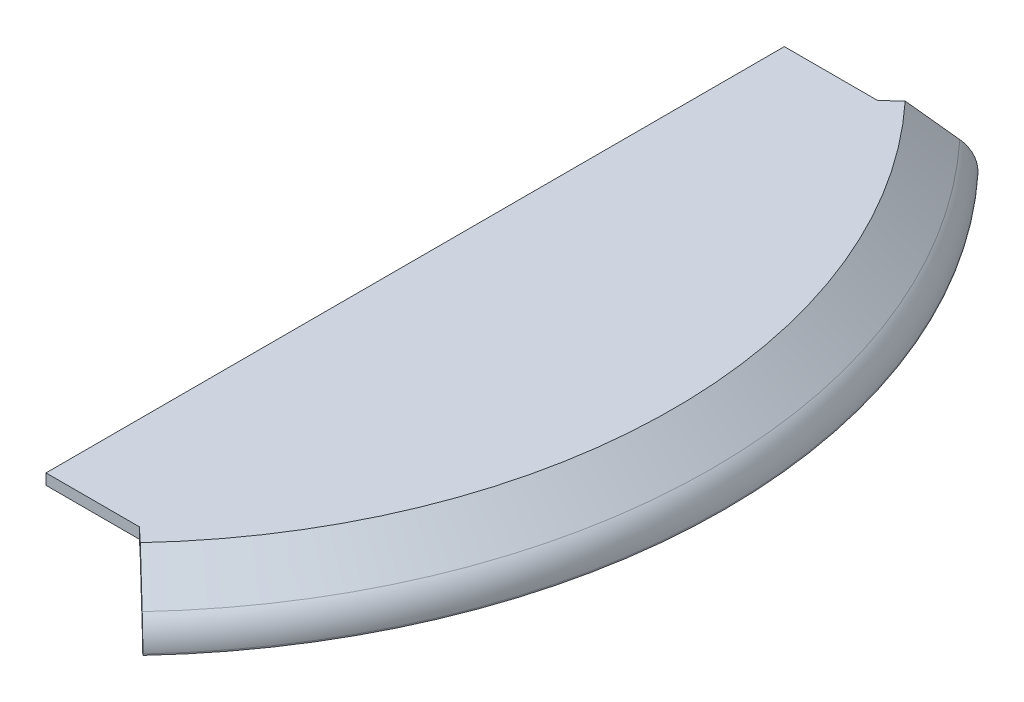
ISO-10303-21;
HEADER;
FILE_DESCRIPTION(('STEP AP214'),'2;1');
FILE_NAME('part.step','',(''),(''),'','','');
FILE_SCHEMA(('AUTOMOTIVE_DESIGN { 1 0 10303 214 1 1 1 1 }'));
ENDSEC;
DATA;
#1=APPLICATION_CONTEXT('core data for automotive mechanical design processes');
#2=APPLICATION_PROTOCOL_DEFINITION('international standard','automotive_design',2000,#1);
#3=PRODUCT_CONTEXT('',#1,'mechanical');
#4=PRODUCT('Part','Part','',(#3));
#5=PRODUCT_RELATED_PRODUCT_CATEGORY('part','',(#4));
#6=PRODUCT_DEFINITION_FORMATION('','',#4);
#7=PRODUCT_DEFINITION_CONTEXT('part definition',#1,'design');
#8=PRODUCT_DEFINITION('design','',#6,#7);
#9=PRODUCT_DEFINITION_SHAPE('','',#8);
#10=(LENGTH_UNIT() NAMED_UNIT(*) SI_UNIT(.MILLI.,.METRE.));
#11=(NAMED_UNIT(*) PLANE_ANGLE_UNIT() SI_UNIT($,.RADIAN.));
#12=(NAMED_UNIT(*) SI_UNIT($,.STERADIAN.) SOLID_ANGLE_UNIT());
#13=UNCERTAINTY_MEASURE_WITH_UNIT(LENGTH_MEASURE(1.E-05),#10,'distance_accuracy_value','');
#14=(GEOMETRIC_REPRESENTATION_CONTEXT(3) GLOBAL_UNCERTAINTY_ASSIGNED_CONTEXT((#13)) GLOBAL_UNIT_ASSIGNED_CONTEXT((#10,
#11,#12)) REPRESENTATION_CONTEXT('',''));
#15=CARTESIAN_POINT('',(0.,0.,0.));
#16=DIRECTION('',(0.,0.,1.));
#17=DIRECTION('',(1.,0.,0.));
#18=AXIS2_PLACEMENT_3D('',#15,#16,#17);
#19=CARTESIAN_POINT('',(0.,-23.4118667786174,0.));
#20=DIRECTION('',(0.,-1.,0.));
#21=DIRECTION('',(0.,0.,-1.));
#22=AXIS2_PLACEMENT_3D('',#19,#20,#21);
#23=CYLINDRICAL_SURFACE('',#22,170.);
#24=DIRECTION('',(0.,1.,0.));
#25=VECTOR('',#24,1.);
#26=CARTESIAN_POINT('',(124.330129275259,0.,-115.939721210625));
#27=LINE('',#26,#25);
#28=CARTESIAN_POINT('',(124.330129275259,0.,-115.939721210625));
#29=VERTEX_POINT('',#28);
#30=CARTESIAN_POINT('',(124.330129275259,0.336923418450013,-115.939721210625));
#31=VERTEX_POINT('',#30);
#32=EDGE_CURVE('E129',#29,#31,#27,.T.);
#33=ORIENTED_EDGE('',*,*,#32,.T.);
#34=CARTESIAN_POINT('',(0.,0.336923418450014,0.));
#35=DIRECTION('',(0.,-1.,0.));
#36=DIRECTION('',(0.,0.,-1.));
#37=AXIS2_PLACEMENT_3D('',#34,#35,#36);
#38=CIRCLE('',#37,170.);
#39=CARTESIAN_POINT('',(124.330129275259,0.336923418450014,115.939721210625));
#40=VERTEX_POINT('',#39);
#41=EDGE_CURVE('E187',#31,#40,#38,.T.);
#42=ORIENTED_EDGE('',*,*,#41,.T.);
#43=DIRECTION('',(0.,1.,0.));
#44=VECTOR('',#43,1.);
#45=CARTESIAN_POINT('',(124.330129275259,0.,115.939721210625));
#46=LINE('',#45,#44);
#47=CARTESIAN_POINT('',(124.330129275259,0.,115.939721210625));
#48=VERTEX_POINT('',#47);
#49=EDGE_CURVE('E45',#48,#40,#46,.T.);
#50=ORIENTED_EDGE('',*,*,#49,.F.);
#51=CARTESIAN_POINT('',(0.,0.,0.));
#52=DIRECTION('',(0.,-1.,0.));
#53=DIRECTION('',(0.,0.,-1.));
#54=AXIS2_PLACEMENT_3D('',#51,#52,#53);
#55=CIRCLE('',#54,170.);
#56=EDGE_CURVE('E206',#29,#48,#55,.T.);
#57=ORIENTED_EDGE('',*,*,#56,.F.);
#58=EDGE_LOOP('',(#33,#42,#50,#57));
#59=FACE_BOUND('',#58,.T.);
#60=ADVANCED_FACE('F31',(#59),#23,.T.);
#61=CARTESIAN_POINT('',(-170.,0.,0.));
#62=DIRECTION('',(0.,1.,0.));
#63=DIRECTION('',(0.,0.,1.));
#64=AXIS2_PLACEMENT_3D('',#61,#62,#63);
#65=PLANE('',#64);
#66=DIRECTION('',(-0.73135370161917,0.,0.681998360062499));
#67=VECTOR('',#66,1.);
#68=CARTESIAN_POINT('',(109.91779277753,0.,-102.5));
#69=LINE('',#68,#67);
#70=CARTESIAN_POINT('',(122.86742187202,0.,-114.5757244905));
#71=VERTEX_POINT('',#70);
#72=EDGE_CURVE('E153',#29,#71,#69,.T.);
#73=ORIENTED_EDGE('',*,*,#72,.F.);
#74=ORIENTED_EDGE('',*,*,#56,.T.);
#75=DIRECTION('',(0.731353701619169,0.,0.6819983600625));
#76=VECTOR('',#75,1.);
#77=CARTESIAN_POINT('',(109.91779277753,0.,102.5));
#78=LINE('',#77,#76);
#79=CARTESIAN_POINT('',(122.86742187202,0.,114.5757244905));
#80=VERTEX_POINT('',#79);
#81=EDGE_CURVE('E151',#80,#48,#78,.T.);
#82=ORIENTED_EDGE('',*,*,#81,.F.);
#83=CARTESIAN_POINT('',(0.,0.,0.));
#84=DIRECTION('',(0.,-1.,0.));
#85=DIRECTION('',(0.,0.,-1.));
#86=AXIS2_PLACEMENT_3D('',#83,#84,#85);
#87=CIRCLE('',#86,168.);
#88=EDGE_CURVE('E203',#71,#80,#87,.T.);
#89=ORIENTED_EDGE('',*,*,#88,.F.);
#90=EDGE_LOOP('',(#73,#74,#82,#89));
#91=FACE_BOUND('',#90,.T.);
#92=ADVANCED_FACE('F223',(#91),#65,.F.);
#93=CARTESIAN_POINT('',(0.,-23.4118667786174,0.));
#94=DIRECTION('',(0.,-1.,0.));
#95=DIRECTION('',(0.,0.,-1.));
#96=AXIS2_PLACEMENT_3D('',#93,#94,#95);
#97=CYLINDRICAL_SURFACE('',#96,168.);
#98=DIRECTION('',(0.,-1.,0.));
#99=VECTOR('',#98,1.);
#100=CARTESIAN_POINT('',(122.86742187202,-23.4118667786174,-114.5757244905));
#101=LINE('',#100,#99);
#102=CARTESIAN_POINT('',(122.867421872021,3.5,-114.5757244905));
#103=VERTEX_POINT('',#102);
#104=EDGE_CURVE('E180',#71,#103,#101,.F.);
#105=ORIENTED_EDGE('',*,*,#104,.F.);
#106=ORIENTED_EDGE('',*,*,#88,.T.);
#107=DIRECTION('',(0.,-1.,0.));
#108=VECTOR('',#107,1.);
#109=CARTESIAN_POINT('',(122.86742187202,-23.4118667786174,114.5757244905));
#110=LINE('',#109,#108);
#111=CARTESIAN_POINT('',(122.86742187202,3.5,114.5757244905));
#112=VERTEX_POINT('',#111);
#113=EDGE_CURVE('E171',#112,#80,#110,.T.);
#114=ORIENTED_EDGE('',*,*,#113,.F.);
#115=CARTESIAN_POINT('',(0.,3.5,0.));
#116=DIRECTION('',(0.,-1.,0.));
#117=DIRECTION('',(0.,0.,-1.));
#118=AXIS2_PLACEMENT_3D('',#115,#116,#117);
#119=CIRCLE('',#118,168.);
#120=EDGE_CURVE('E200',#103,#112,#119,.T.);
#121=ORIENTED_EDGE('',*,*,#120,.F.);
#122=EDGE_LOOP('',(#105,#106,#114,#121));
#123=FACE_BOUND('',#122,.T.);
#124=ADVANCED_FACE('F229',(#123),#97,.F.);
#125=CARTESIAN_POINT('',(-167.12045890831,3.5,0.));
#126=DIRECTION('',(0.,1.,0.));
#127=DIRECTION('',(0.,0.,1.));
#128=AXIS2_PLACEMENT_3D('',#125,#126,#127);
#129=PLANE('',#128);
#130=DIRECTION('',(-0.73135370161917,0.,0.681998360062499));
#131=VECTOR('',#130,1.);
#132=CARTESIAN_POINT('',(-89.3890964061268,3.5,83.3566809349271));
#133=LINE('',#132,#131);
#134=CARTESIAN_POINT('',(122.224166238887,3.5,-113.97587890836));
#135=VERTEX_POINT('',#134);
#136=EDGE_CURVE('E178',#103,#135,#133,.T.);
#137=ORIENTED_EDGE('',*,*,#136,.F.);
#138=ORIENTED_EDGE('',*,*,#120,.T.);
#139=DIRECTION('',(0.731353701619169,0.,0.6819983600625));
#140=VECTOR('',#139,1.);
#141=CARTESIAN_POINT('',(-89.3890964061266,3.5,-83.3566809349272));
#142=LINE('',#141,#140);
#143=CARTESIAN_POINT('',(122.224166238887,3.5,113.97587890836));
#144=VERTEX_POINT('',#143);
#145=EDGE_CURVE('E169',#144,#112,#142,.T.);
#146=ORIENTED_EDGE('',*,*,#145,.F.);
#147=CARTESIAN_POINT('',(0.,3.5,0.));
#148=DIRECTION('',(0.,-1.,0.));
#149=DIRECTION('',(0.,0.,-1.));
#150=AXIS2_PLACEMENT_3D('',#147,#148,#149);
#151=CIRCLE('',#150,167.12045890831);
#152=EDGE_CURVE('E197',#135,#144,#151,.T.);
#153=ORIENTED_EDGE('',*,*,#152,.F.);
#154=EDGE_LOOP('',(#137,#138,#146,#153));
#155=FACE_BOUND('',#154,.T.);
#156=ADVANCED_FACE('F233',(#155),#129,.F.);
#157=CARTESIAN_POINT('',(0.,3.5,0.));
#158=DIRECTION('',(0.,-1.,0.));
#159=DIRECTION('',(0.,0.,-1.));
#160=AXIS2_PLACEMENT_3D('',#157,#158,#159);
#161=CONICAL_SURFACE('',#160,167.12045890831,0.872664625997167);
#162=DIRECTION('',(0.560249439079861,-0.642787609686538,-0.522441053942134));
#163=VECTOR('',#162,1.);
#164=CARTESIAN_POINT('',(0.,143.73071543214,0.));
#165=LINE('',#164,#163);
#166=CARTESIAN_POINT('',(113.072435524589,14.,-105.441751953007));
#167=VERTEX_POINT('',#166);
#168=EDGE_CURVE('E176',#135,#167,#165,.F.);
#169=ORIENTED_EDGE('',*,*,#168,.F.);
#170=ORIENTED_EDGE('',*,*,#152,.T.);
#171=DIRECTION('',(-0.560249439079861,0.642787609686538,-0.522441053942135));
#172=VECTOR('',#171,1.);
#173=CARTESIAN_POINT('',(0.,143.73071543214,0.));
#174=LINE('',#173,#172);
#175=CARTESIAN_POINT('',(113.072435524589,14.,105.441751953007));
#176=VERTEX_POINT('',#175);
#177=EDGE_CURVE('E167',#176,#144,#174,.F.);
#178=ORIENTED_EDGE('',*,*,#177,.F.);
#179=CARTESIAN_POINT('',(0.,14.,0.));
#180=DIRECTION('',(0.,-1.,0.));
#181=DIRECTION('',(0.,0.,-1.));
#182=AXIS2_PLACEMENT_3D('',#179,#180,#181);
#183=CIRCLE('',#182,154.607046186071);
#184=EDGE_CURVE('E194',#167,#176,#183,.T.);
#185=ORIENTED_EDGE('',*,*,#184,.F.);
#186=EDGE_LOOP('',(#169,#170,#178,#185));
#187=FACE_BOUND('',#186,.T.);
#188=ADVANCED_FACE('F238',(#187),#161,.F.);
#189=CARTESIAN_POINT('',(0.,14.,0.));
#190=DIRECTION('',(0.,1.,0.));
#191=DIRECTION('',(0.,0.,1.));
#192=AXIS2_PLACEMENT_3D('',#189,#190,#191);
#193=PLANE('',#192);
#194=DIRECTION('',(-0.73135370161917,0.,0.681998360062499));
#195=VECTOR('',#194,1.);
#196=CARTESIAN_POINT('',(0.,14.,0.));
#197=LINE('',#196,#195);
#198=CARTESIAN_POINT('',(109.91779277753,14.,-102.5));
#199=VERTEX_POINT('',#198);
#200=EDGE_CURVE('E125',#167,#199,#197,.T.);
#201=ORIENTED_EDGE('',*,*,#200,.F.);
#202=ORIENTED_EDGE('',*,*,#184,.T.);
#203=DIRECTION('',(0.731353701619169,0.,0.6819983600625));
#204=VECTOR('',#203,1.);
#205=CARTESIAN_POINT('',(0.,14.,0.));
#206=LINE('',#205,#204);
#207=CARTESIAN_POINT('',(109.91779277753,14.,102.5));
#208=VERTEX_POINT('',#207);
#209=EDGE_CURVE('E165',#208,#176,#206,.T.);
#210=ORIENTED_EDGE('',*,*,#209,.F.);
#211=DIRECTION('',(1.,0.,0.));
#212=VECTOR('',#211,1.);
#213=CARTESIAN_POINT('',(0.,14.,102.5));
#214=LINE('',#213,#212);
#215=CARTESIAN_POINT('',(83.9999999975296,14.,102.5));
#216=VERTEX_POINT('',#215);
#217=EDGE_CURVE('E185',#216,#208,#214,.T.);
#218=ORIENTED_EDGE('',*,*,#217,.F.);
#219=DIRECTION('',(0.,0.,1.));
#220=VECTOR('',#219,1.);
#221=CARTESIAN_POINT('',(83.9999999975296,14.,0.));
#222=LINE('',#221,#220);
#223=CARTESIAN_POINT('',(83.9999999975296,14.,-102.5));
#224=VERTEX_POINT('',#223);
#225=EDGE_CURVE('E53',#224,#216,#222,.T.);
#226=ORIENTED_EDGE('',*,*,#225,.F.);
#227=DIRECTION('',(-1.,0.,0.));
#228=VECTOR('',#227,1.);
#229=CARTESIAN_POINT('',(0.,14.,-102.5));
#230=LINE('',#229,#228);
#231=EDGE_CURVE('E182',#199,#224,#230,.T.);
#232=ORIENTED_EDGE('',*,*,#231,.F.);
#233=EDGE_LOOP('',(#201,#202,#210,#218,#226,#232));
#234=FACE_BOUND('',#233,.T.);
#235=ADVANCED_FACE('F242',(#234),#193,.F.);
#236=CARTESIAN_POINT('',(-155.698956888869,17.,0.));
#237=DIRECTION('',(0.,-1.,0.));
#238=DIRECTION('',(0.,0.,-1.));
#239=AXIS2_PLACEMENT_3D('',#236,#237,#238);
#240=PLANE('',#239);
#241=DIRECTION('',(-0.73135370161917,0.,0.681998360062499));
#242=VECTOR('',#241,1.);
#243=CARTESIAN_POINT('',(109.91779277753,16.9999999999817,-102.5));
#244=LINE('',#243,#242);
#245=CARTESIAN_POINT('',(113.871008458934,16.9999999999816,-106.186433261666));
#246=VERTEX_POINT('',#245);
#247=CARTESIAN_POINT('',(109.91779277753,16.9999999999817,-102.5));
#248=VERTEX_POINT('',#247);
#249=EDGE_CURVE('E122',#246,#248,#244,.T.);
#250=ORIENTED_EDGE('',*,*,#249,.T.);
#251=DIRECTION('',(-1.,0.,0.));
#252=VECTOR('',#251,1.);
#253=CARTESIAN_POINT('',(83.9999999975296,16.9999999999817,-102.5));
#254=LINE('',#253,#252);
#255=CARTESIAN_POINT('',(83.9999999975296,16.9999999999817,-102.5));
#256=VERTEX_POINT('',#255);
#257=EDGE_CURVE('E132',#248,#256,#254,.T.);
#258=ORIENTED_EDGE('',*,*,#257,.T.);
#259=DIRECTION('',(0.,0.,1.));
#260=VECTOR('',#259,1.);
#261=CARTESIAN_POINT('',(83.9999999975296,16.9999999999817,102.5));
#262=LINE('',#261,#260);
#263=CARTESIAN_POINT('',(83.9999999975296,16.9999999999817,102.5));
#264=VERTEX_POINT('',#263);
#265=EDGE_CURVE('E137',#256,#264,#262,.T.);
#266=ORIENTED_EDGE('',*,*,#265,.T.);
#267=DIRECTION('',(1.,0.,0.));
#268=VECTOR('',#267,1.);
#269=CARTESIAN_POINT('',(83.9999999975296,16.9999999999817,102.5));
#270=LINE('',#269,#268);
#271=CARTESIAN_POINT('',(109.91779277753,16.9999999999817,102.5));
#272=VERTEX_POINT('',#271);
#273=EDGE_CURVE('E146',#264,#272,#270,.T.);
#274=ORIENTED_EDGE('',*,*,#273,.T.);
#275=DIRECTION('',(0.731353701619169,0.,0.6819983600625));
#276=VECTOR('',#275,1.);
#277=CARTESIAN_POINT('',(109.91779277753,16.9999999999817,102.5));
#278=LINE('',#277,#276);
#279=CARTESIAN_POINT('',(113.871008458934,16.9999999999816,106.186433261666));
#280=VERTEX_POINT('',#279);
#281=EDGE_CURVE('E144',#272,#280,#278,.T.);
#282=ORIENTED_EDGE('',*,*,#281,.T.);
#283=CARTESIAN_POINT('',(0.,17.,0.));
#284=DIRECTION('',(0.,-1.,0.));
#285=DIRECTION('',(0.,0.,-1.));
#286=AXIS2_PLACEMENT_3D('',#283,#284,#285);
#287=CIRCLE('',#286,155.698956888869);
#288=EDGE_CURVE('E143',#246,#280,#287,.T.);
#289=ORIENTED_EDGE('',*,*,#288,.F.);
#290=EDGE_LOOP('',(#250,#258,#266,#274,#282,#289));
#291=FACE_BOUND('',#290,.T.);
#292=ADVANCED_FACE('F140',(#291),#240,.F.);
#293=CARTESIAN_POINT('',(0.,17.,0.));
#294=DIRECTION('',(0.,-1.,0.));
#295=DIRECTION('',(0.,0.,-1.));
#296=AXIS2_PLACEMENT_3D('',#293,#294,#295);
#297=CONICAL_SURFACE('',#296,155.698956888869,0.872664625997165);
#298=DIRECTION('',(0.56024943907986,-0.642787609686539,-0.522441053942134));
#299=VECTOR('',#298,1.);
#300=CARTESIAN_POINT('',(0.,147.646937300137,0.));
#301=LINE('',#300,#299);
#302=CARTESIAN_POINT('',(121.717643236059,7.99736784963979,-113.503538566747));
#303=VERTEX_POINT('',#302);
#304=EDGE_CURVE('E173',#246,#303,#301,.T.);
#305=ORIENTED_EDGE('',*,*,#304,.F.);
#306=ORIENTED_EDGE('',*,*,#288,.T.);
#307=DIRECTION('',(-0.56024943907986,0.642787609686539,-0.522441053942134));
#308=VECTOR('',#307,1.);
#309=CARTESIAN_POINT('',(0.,147.646937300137,0.));
#310=LINE('',#309,#308);
#311=CARTESIAN_POINT('',(121.717643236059,7.99736784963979,113.503538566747));
#312=VERTEX_POINT('',#311);
#313=EDGE_CURVE('E158',#312,#280,#310,.T.);
#314=ORIENTED_EDGE('',*,*,#313,.F.);
#315=CARTESIAN_POINT('',(0.,7.99736784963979,0.));
#316=DIRECTION('',(0.,-1.,0.));
#317=DIRECTION('',(0.,0.,-1.));
#318=AXIS2_PLACEMENT_3D('',#315,#316,#317);
#319=CIRCLE('',#318,166.427876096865);
#320=EDGE_CURVE('E190',#303,#312,#319,.T.);
#321=ORIENTED_EDGE('',*,*,#320,.F.);
#322=EDGE_LOOP('',(#305,#306,#314,#321));
#323=FACE_BOUND('',#322,.T.);
#324=ADVANCED_FACE('F215',(#323),#297,.T.);
#325=CARTESIAN_POINT('',(0.,0.336923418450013,0.));
#326=DIRECTION('',(0.,-1.,0.));
#327=DIRECTION('',(0.,0.,-1.));
#328=AXIS2_PLACEMENT_3D('',#325,#326,#327);
#329=TOROIDAL_SURFACE('',#328,160.,10.);
#330=CARTESIAN_POINT('',(117.016592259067,0.336923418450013,-109.11973761));
#331=DIRECTION('',(-0.681998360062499,0.,-0.73135370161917));
#332=DIRECTION('',(-0.73135370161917,0.,0.681998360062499));
#333=AXIS2_PLACEMENT_3D('',#330,#331,#332);
#334=CIRCLE('',#333,10.);
#335=EDGE_CURVE('E12',#303,#31,#334,.T.);
#336=ORIENTED_EDGE('',*,*,#335,.F.);
#337=ORIENTED_EDGE('',*,*,#320,.T.);
#338=CARTESIAN_POINT('',(117.016592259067,0.336923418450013,109.11973761));
#339=DIRECTION('',(-0.6819983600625,0.,0.731353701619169));
#340=DIRECTION('',(0.731353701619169,0.,0.6819983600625));
#341=AXIS2_PLACEMENT_3D('',#338,#339,#340);
#342=CIRCLE('',#341,10.);
#343=EDGE_CURVE('E38',#40,#312,#342,.T.);
#344=ORIENTED_EDGE('',*,*,#343,.F.);
#345=ORIENTED_EDGE('',*,*,#41,.F.);
#346=EDGE_LOOP('',(#336,#337,#344,#345));
#347=FACE_BOUND('',#346,.T.);
#348=ADVANCED_FACE('F217',(#347),#329,.T.);
#349=CARTESIAN_POINT('',(83.9999999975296,0.,102.5));
#350=DIRECTION('',(0.,0.,1.));
#351=DIRECTION('',(1.,0.,0.));
#352=AXIS2_PLACEMENT_3D('',#349,#350,#351);
#353=PLANE('',#352);
#354=ORIENTED_EDGE('',*,*,#217,.T.);
#355=DIRECTION('',(0.,1.,0.));
#356=VECTOR('',#355,1.);
#357=CARTESIAN_POINT('',(109.91779277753,0.,102.5));
#358=LINE('',#357,#356);
#359=EDGE_CURVE('E155',#208,#272,#358,.T.);
#360=ORIENTED_EDGE('',*,*,#359,.T.);
#361=ORIENTED_EDGE('',*,*,#273,.F.);
#362=DIRECTION('',(0.,1.,0.));
#363=VECTOR('',#362,1.);
#364=CARTESIAN_POINT('',(83.9999999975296,0.,102.5));
#365=LINE('',#364,#363);
#366=EDGE_CURVE('E156',#216,#264,#365,.T.);
#367=ORIENTED_EDGE('',*,*,#366,.F.);
#368=EDGE_LOOP('',(#354,#360,#361,#367));
#369=FACE_BOUND('',#368,.T.);
#370=ADVANCED_FACE('F248',(#369),#353,.T.);
#371=CARTESIAN_POINT('',(83.9999999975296,0.,102.5));
#372=DIRECTION('',(-1.,0.,0.));
#373=DIRECTION('',(0.,0.,1.));
#374=AXIS2_PLACEMENT_3D('',#371,#372,#373);
#375=PLANE('',#374);
#376=ORIENTED_EDGE('',*,*,#225,.T.);
#377=ORIENTED_EDGE('',*,*,#366,.T.);
#378=ORIENTED_EDGE('',*,*,#265,.F.);
#379=DIRECTION('',(0.,1.,0.));
#380=VECTOR('',#379,1.);
#381=CARTESIAN_POINT('',(83.9999999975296,0.,-102.5));
#382=LINE('',#381,#380);
#383=EDGE_CURVE('E128',#224,#256,#382,.T.);
#384=ORIENTED_EDGE('',*,*,#383,.F.);
#385=EDGE_LOOP('',(#376,#377,#378,#384));
#386=FACE_BOUND('',#385,.T.);
#387=ADVANCED_FACE('F244',(#386),#375,.T.);
#388=CARTESIAN_POINT('',(83.9999999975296,0.,-102.5));
#389=DIRECTION('',(0.,0.,-1.));
#390=DIRECTION('',(-1.,0.,0.));
#391=AXIS2_PLACEMENT_3D('',#388,#389,#390);
#392=PLANE('',#391);
#393=ORIENTED_EDGE('',*,*,#231,.T.);
#394=ORIENTED_EDGE('',*,*,#383,.T.);
#395=ORIENTED_EDGE('',*,*,#257,.F.);
#396=DIRECTION('',(0.,1.,0.));
#397=VECTOR('',#396,1.);
#398=CARTESIAN_POINT('',(109.91779277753,0.,-102.5));
#399=LINE('',#398,#397);
#400=EDGE_CURVE('E118',#199,#248,#399,.T.);
#401=ORIENTED_EDGE('',*,*,#400,.F.);
#402=EDGE_LOOP('',(#393,#394,#395,#401));
#403=FACE_BOUND('',#402,.T.);
#404=ADVANCED_FACE('F133',(#403),#392,.T.);
#405=CARTESIAN_POINT('',(109.91779277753,0.,-102.5));
#406=DIRECTION('',(-0.681998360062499,0.,-0.73135370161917));
#407=DIRECTION('',(-0.73135370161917,0.,0.681998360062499));
#408=AXIS2_PLACEMENT_3D('',#405,#406,#407);
#409=PLANE('',#408);
#410=ORIENTED_EDGE('',*,*,#104,.T.);
#411=ORIENTED_EDGE('',*,*,#136,.T.);
#412=ORIENTED_EDGE('',*,*,#168,.T.);
#413=ORIENTED_EDGE('',*,*,#200,.T.);
#414=ORIENTED_EDGE('',*,*,#400,.T.);
#415=ORIENTED_EDGE('',*,*,#249,.F.);
#416=ORIENTED_EDGE('',*,*,#304,.T.);
#417=ORIENTED_EDGE('',*,*,#335,.T.);
#418=ORIENTED_EDGE('',*,*,#32,.F.);
#419=ORIENTED_EDGE('',*,*,#72,.T.);
#420=EDGE_LOOP('',(#410,#411,#412,#413,#414,#415,#416,#417,#418,#419));
#421=FACE_BOUND('',#420,.T.);
#422=ADVANCED_FACE('F120',(#421),#409,.T.);
#423=CARTESIAN_POINT('',(109.91779277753,0.,102.5));
#424=DIRECTION('',(-0.6819983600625,0.,0.731353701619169));
#425=DIRECTION('',(0.731353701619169,0.,0.6819983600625));
#426=AXIS2_PLACEMENT_3D('',#423,#424,#425);
#427=PLANE('',#426);
#428=ORIENTED_EDGE('',*,*,#113,.T.);
#429=ORIENTED_EDGE('',*,*,#81,.T.);
#430=ORIENTED_EDGE('',*,*,#49,.T.);
#431=ORIENTED_EDGE('',*,*,#343,.T.);
#432=ORIENTED_EDGE('',*,*,#313,.T.);
#433=ORIENTED_EDGE('',*,*,#281,.F.);
#434=ORIENTED_EDGE('',*,*,#359,.F.);
#435=ORIENTED_EDGE('',*,*,#209,.T.);
#436=ORIENTED_EDGE('',*,*,#177,.T.);
#437=ORIENTED_EDGE('',*,*,#145,.T.);
#438=EDGE_LOOP('',(#428,#429,#430,#431,#432,#433,#434,#435,#436,#437));
#439=FACE_BOUND('',#438,.T.);
#440=ADVANCED_FACE('F209',(#439),#427,.T.);
#441=CLOSED_SHELL('',(#60,#92,#124,#156,#188,#235,#292,#324,#348,#370,#387,#404,#422,#440));
#442=MANIFOLD_SOLID_BREP('B2',#441);
#443=ADVANCED_BREP_SHAPE_REPRESENTATION('',(#18,#442),#14);
#444=SHAPE_DEFINITION_REPRESENTATION(#9,#443);
ENDSEC;
END-ISO-10303-21;
